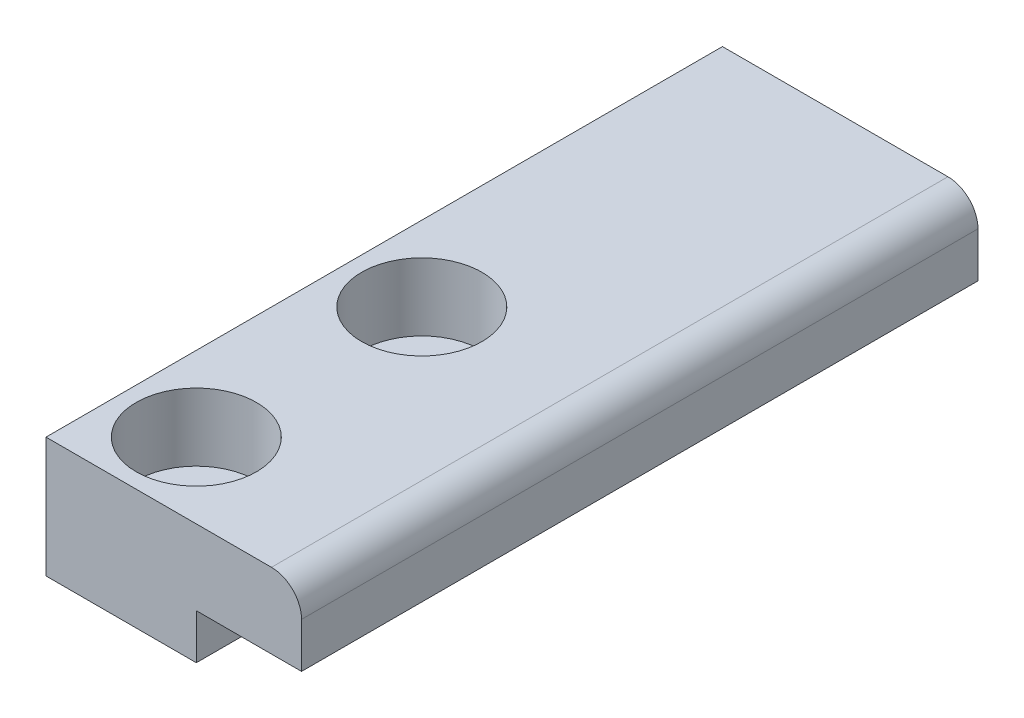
ISO-10303-21;
HEADER;
FILE_DESCRIPTION(('STEP AP214'),'2;1');
FILE_NAME('part.step','',(''),(''),'','','');
FILE_SCHEMA(('AUTOMOTIVE_DESIGN { 1 0 10303 214 1 1 1 1 }'));
ENDSEC;
DATA;
#1=APPLICATION_CONTEXT('core data for automotive mechanical design processes');
#2=APPLICATION_PROTOCOL_DEFINITION('international standard','automotive_design',2000,#1);
#3=PRODUCT_CONTEXT('',#1,'mechanical');
#4=PRODUCT('Part','Part','',(#3));
#5=PRODUCT_RELATED_PRODUCT_CATEGORY('part','',(#4));
#6=PRODUCT_DEFINITION_FORMATION('','',#4);
#7=PRODUCT_DEFINITION_CONTEXT('part definition',#1,'design');
#8=PRODUCT_DEFINITION('design','',#6,#7);
#9=PRODUCT_DEFINITION_SHAPE('','',#8);
#10=(LENGTH_UNIT() NAMED_UNIT(*) SI_UNIT(.MILLI.,.METRE.));
#11=(NAMED_UNIT(*) PLANE_ANGLE_UNIT() SI_UNIT($,.RADIAN.));
#12=(NAMED_UNIT(*) SI_UNIT($,.STERADIAN.) SOLID_ANGLE_UNIT());
#13=UNCERTAINTY_MEASURE_WITH_UNIT(LENGTH_MEASURE(1.E-05),#10,'distance_accuracy_value','');
#14=(GEOMETRIC_REPRESENTATION_CONTEXT(3) GLOBAL_UNCERTAINTY_ASSIGNED_CONTEXT((#13)) GLOBAL_UNIT_ASSIGNED_CONTEXT((#10,
#11,#12)) REPRESENTATION_CONTEXT('',''));
#15=CARTESIAN_POINT('',(0.,0.,0.));
#16=DIRECTION('',(0.,0.,1.));
#17=DIRECTION('',(1.,0.,0.));
#18=AXIS2_PLACEMENT_3D('',#15,#16,#17);
#19=CARTESIAN_POINT('',(4.99999999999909,-37.,25.));
#20=DIRECTION('',(0.,1.,0.));
#21=DIRECTION('',(0.,0.,1.));
#22=AXIS2_PLACEMENT_3D('',#19,#20,#21);
#23=CYLINDRICAL_SURFACE('',#22,2.25);
#24=CARTESIAN_POINT('',(4.99999999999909,0.,25.));
#25=DIRECTION('',(0.,1.,0.));
#26=DIRECTION('',(0.,0.,1.));
#27=AXIS2_PLACEMENT_3D('',#24,#25,#26);
#28=CIRCLE('',#27,2.25);
#29=CARTESIAN_POINT('',(4.99999999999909,0.,27.25));
#30=VERTEX_POINT('',#29);
#31=EDGE_CURVE('E148',#30,#30,#28,.T.);
#32=CARTESIAN_POINT('',(4.99999999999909,3.5,25.));
#33=DIRECTION('',(0.,1.,0.));
#34=DIRECTION('',(0.,0.,1.));
#35=AXIS2_PLACEMENT_3D('',#32,#33,#34);
#36=CIRCLE('',#35,2.25);
#37=CARTESIAN_POINT('',(4.99999999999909,3.5,27.25));
#38=VERTEX_POINT('',#37);
#39=EDGE_CURVE('E36',#38,#38,#36,.F.);
#40=CARTESIAN_POINT('',(4.99999999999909,0.,27.25));
#41=CARTESIAN_POINT('',(4.99999999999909,0.0364583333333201,27.25));
#42=CARTESIAN_POINT('',(4.99999999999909,0.072916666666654,27.25));
#43=CARTESIAN_POINT('',(4.99999999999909,0.145833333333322,27.25));
#44=CARTESIAN_POINT('',(4.99999999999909,0.182291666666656,27.25));
#45=CARTESIAN_POINT('',(4.99999999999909,0.255208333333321,27.25));
#46=CARTESIAN_POINT('',(4.99999999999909,0.291666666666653,27.25));
#47=CARTESIAN_POINT('',(4.99999999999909,0.364583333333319,27.25));
#48=CARTESIAN_POINT('',(4.99999999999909,0.401041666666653,27.25));
#49=CARTESIAN_POINT('',(4.99999999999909,0.47395833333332,27.25));
#50=CARTESIAN_POINT('',(4.99999999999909,0.510416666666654,27.25));
#51=CARTESIAN_POINT('',(4.99999999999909,0.583333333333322,27.25));
#52=CARTESIAN_POINT('',(4.99999999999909,0.619791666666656,27.25));
#53=CARTESIAN_POINT('',(4.99999999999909,0.692708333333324,27.25));
#54=CARTESIAN_POINT('',(4.99999999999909,0.729166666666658,27.25));
#55=CARTESIAN_POINT('',(4.99999999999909,0.802083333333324,27.25));
#56=CARTESIAN_POINT('',(4.99999999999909,0.838541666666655,27.25));
#57=CARTESIAN_POINT('',(4.99999999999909,0.911458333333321,27.25));
#58=CARTESIAN_POINT('',(4.99999999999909,0.947916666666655,27.25));
#59=CARTESIAN_POINT('',(4.99999999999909,1.02083333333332,27.25));
#60=CARTESIAN_POINT('',(4.99999999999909,1.05729166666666,27.25));
#61=CARTESIAN_POINT('',(4.99999999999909,1.13020833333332,27.25));
#62=CARTESIAN_POINT('',(4.99999999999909,1.16666666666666,27.25));
#63=CARTESIAN_POINT('',(4.99999999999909,1.23958333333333,27.25));
#64=CARTESIAN_POINT('',(4.99999999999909,1.27604166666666,27.25));
#65=CARTESIAN_POINT('',(4.99999999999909,1.34895833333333,27.25));
#66=CARTESIAN_POINT('',(4.99999999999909,1.38541666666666,27.25));
#67=CARTESIAN_POINT('',(4.99999999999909,1.45833333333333,27.25));
#68=CARTESIAN_POINT('',(4.99999999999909,1.49479166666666,27.25));
#69=CARTESIAN_POINT('',(4.99999999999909,1.56770833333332,27.25));
#70=CARTESIAN_POINT('',(4.99999999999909,1.60416666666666,27.25));
#71=CARTESIAN_POINT('',(4.99999999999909,1.67708333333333,27.25));
#72=CARTESIAN_POINT('',(4.99999999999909,1.71354166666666,27.25));
#73=CARTESIAN_POINT('',(4.99999999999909,1.78645833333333,27.25));
#74=CARTESIAN_POINT('',(4.99999999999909,1.82291666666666,27.25));
#75=CARTESIAN_POINT('',(4.99999999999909,1.89583333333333,27.25));
#76=CARTESIAN_POINT('',(4.99999999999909,1.93229166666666,27.25));
#77=CARTESIAN_POINT('',(4.99999999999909,2.00520833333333,27.25));
#78=CARTESIAN_POINT('',(4.99999999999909,2.04166666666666,27.25));
#79=CARTESIAN_POINT('',(4.99999999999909,2.11458333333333,27.25));
#80=CARTESIAN_POINT('',(4.99999999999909,2.15104166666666,27.25));
#81=CARTESIAN_POINT('',(4.99999999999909,2.22395833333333,27.25));
#82=CARTESIAN_POINT('',(4.99999999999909,2.26041666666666,27.25));
#83=CARTESIAN_POINT('',(4.99999999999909,2.33333333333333,27.25));
#84=CARTESIAN_POINT('',(4.99999999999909,2.36979166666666,27.25));
#85=CARTESIAN_POINT('',(4.99999999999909,2.44270833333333,27.25));
#86=CARTESIAN_POINT('',(4.99999999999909,2.47916666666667,27.25));
#87=CARTESIAN_POINT('',(4.99999999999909,2.55208333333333,27.25));
#88=CARTESIAN_POINT('',(4.99999999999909,2.58854166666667,27.25));
#89=CARTESIAN_POINT('',(4.99999999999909,2.66145833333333,27.25));
#90=CARTESIAN_POINT('',(4.99999999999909,2.69791666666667,27.25));
#91=CARTESIAN_POINT('',(4.99999999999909,2.77083333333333,27.25));
#92=CARTESIAN_POINT('',(4.99999999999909,2.80729166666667,27.25));
#93=CARTESIAN_POINT('',(4.99999999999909,2.88020833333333,27.25));
#94=CARTESIAN_POINT('',(4.99999999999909,2.91666666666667,27.25));
#95=CARTESIAN_POINT('',(4.99999999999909,2.98958333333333,27.25));
#96=CARTESIAN_POINT('',(4.99999999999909,3.02604166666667,27.25));
#97=CARTESIAN_POINT('',(4.99999999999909,3.09895833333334,27.25));
#98=CARTESIAN_POINT('',(4.99999999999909,3.13541666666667,27.25));
#99=CARTESIAN_POINT('',(4.99999999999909,3.20833333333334,27.25));
#100=CARTESIAN_POINT('',(4.99999999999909,3.24479166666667,27.25));
#101=CARTESIAN_POINT('',(4.99999999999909,3.31770833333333,27.25));
#102=CARTESIAN_POINT('',(4.99999999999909,3.35416666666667,27.25));
#103=CARTESIAN_POINT('',(4.99999999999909,3.42708333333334,27.25));
#104=CARTESIAN_POINT('',(4.99999999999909,3.46354166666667,27.25));
#105=CARTESIAN_POINT('',(4.99999999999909,3.5,27.25));
#106=B_SPLINE_CURVE_WITH_KNOTS('',3,(#40,#41,#42,#43,#44,#45,#46,#47,#48,#49,#50,#51,#52,#53,
#54,#55,#56,#57,#58,#59,#60,#61,#62,#63,#64,#65,#66,#67,#68,#69,#70,#71,#72,#73,#74,#75,#76,#77,
#78,#79,#80,#81,#82,#83,#84,#85,#86,#87,#88,#89,#90,#91,#92,#93,#94,#95,#96,#97,#98,#99,#100,
#101,#102,#103,#104,#105),.UNSPECIFIED.,.F.,.F.,(4,2,2,2,2,2,2,2,2,2,2,2,2,2,2,2,2,2,2,2,2,2,2,
2,2,2,2,2,2,2,2,2,4),(0.,0.109375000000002,0.218750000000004,0.328124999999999,0.4375,
0.546875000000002,0.656250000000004,0.765625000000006,0.875000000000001,0.984375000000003,
1.09375,1.20312500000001,1.31250000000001,1.42187500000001,1.53125,1.64062500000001,
1.75000000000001,1.85937500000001,1.96875000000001,2.07812500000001,2.18750000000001,
2.29687500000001,2.40625000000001,2.51562500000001,2.62500000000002,2.73437500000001,
2.84375000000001,2.95312500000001,3.06250000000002,3.17187500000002,3.28125000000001,
3.39062500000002,3.50000000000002),.UNSPECIFIED.);
#107=EDGE_CURVE('BSEAM32',#30,#38,#106,.T.);
#108=ORIENTED_EDGE('',*,*,#31,.F.);
#109=ORIENTED_EDGE('',*,*,#39,.F.);
#110=ORIENTED_EDGE('',*,*,#107,.T.);
#111=ORIENTED_EDGE('',*,*,#107,.F.);
#112=EDGE_LOOP('',(#108,#110,#109,#111));
#113=FACE_BOUND('',#112,.T.);
#114=ADVANCED_FACE('F32',(#113),#23,.F.);
#115=CARTESIAN_POINT('',(5.,-37.,40.));
#116=DIRECTION('',(0.,1.,0.));
#117=DIRECTION('',(0.,0.,1.));
#118=AXIS2_PLACEMENT_3D('',#115,#116,#117);
#119=CYLINDRICAL_SURFACE('',#118,2.25);
#120=CARTESIAN_POINT('',(5.,0.,40.));
#121=DIRECTION('',(0.,1.,0.));
#122=DIRECTION('',(0.,0.,1.));
#123=AXIS2_PLACEMENT_3D('',#120,#121,#122);
#124=CIRCLE('',#123,2.25);
#125=CARTESIAN_POINT('',(5.,0.,42.25));
#126=VERTEX_POINT('',#125);
#127=EDGE_CURVE('E129',#126,#126,#124,.T.);
#128=CARTESIAN_POINT('',(5.,3.5,40.));
#129=DIRECTION('',(0.,1.,0.));
#130=DIRECTION('',(0.,0.,1.));
#131=AXIS2_PLACEMENT_3D('',#128,#129,#130);
#132=CIRCLE('',#131,2.25);
#133=CARTESIAN_POINT('',(5.,3.5,42.25));
#134=VERTEX_POINT('',#133);
#135=EDGE_CURVE('E146',#134,#134,#132,.F.);
#136=CARTESIAN_POINT('',(5.,0.,42.25));
#137=CARTESIAN_POINT('',(5.,0.0364583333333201,42.25));
#138=CARTESIAN_POINT('',(5.,0.072916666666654,42.25));
#139=CARTESIAN_POINT('',(5.,0.145833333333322,42.25));
#140=CARTESIAN_POINT('',(5.,0.182291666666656,42.25));
#141=CARTESIAN_POINT('',(5.,0.255208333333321,42.25));
#142=CARTESIAN_POINT('',(5.,0.291666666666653,42.25));
#143=CARTESIAN_POINT('',(5.,0.364583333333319,42.25));
#144=CARTESIAN_POINT('',(5.,0.401041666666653,42.25));
#145=CARTESIAN_POINT('',(5.,0.47395833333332,42.25));
#146=CARTESIAN_POINT('',(5.,0.510416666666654,42.25));
#147=CARTESIAN_POINT('',(5.,0.583333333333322,42.25));
#148=CARTESIAN_POINT('',(5.,0.619791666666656,42.25));
#149=CARTESIAN_POINT('',(5.,0.692708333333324,42.25));
#150=CARTESIAN_POINT('',(5.,0.729166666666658,42.25));
#151=CARTESIAN_POINT('',(5.,0.802083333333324,42.25));
#152=CARTESIAN_POINT('',(5.,0.838541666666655,42.25));
#153=CARTESIAN_POINT('',(5.,0.911458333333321,42.25));
#154=CARTESIAN_POINT('',(5.,0.947916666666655,42.25));
#155=CARTESIAN_POINT('',(5.,1.02083333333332,42.25));
#156=CARTESIAN_POINT('',(5.,1.05729166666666,42.25));
#157=CARTESIAN_POINT('',(5.,1.13020833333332,42.25));
#158=CARTESIAN_POINT('',(5.,1.16666666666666,42.25));
#159=CARTESIAN_POINT('',(5.,1.23958333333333,42.25));
#160=CARTESIAN_POINT('',(5.,1.27604166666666,42.25));
#161=CARTESIAN_POINT('',(5.,1.34895833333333,42.25));
#162=CARTESIAN_POINT('',(5.,1.38541666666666,42.25));
#163=CARTESIAN_POINT('',(5.,1.45833333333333,42.25));
#164=CARTESIAN_POINT('',(5.,1.49479166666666,42.25));
#165=CARTESIAN_POINT('',(5.,1.56770833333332,42.25));
#166=CARTESIAN_POINT('',(5.,1.60416666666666,42.25));
#167=CARTESIAN_POINT('',(5.,1.67708333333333,42.25));
#168=CARTESIAN_POINT('',(5.,1.71354166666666,42.25));
#169=CARTESIAN_POINT('',(5.,1.78645833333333,42.25));
#170=CARTESIAN_POINT('',(5.,1.82291666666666,42.25));
#171=CARTESIAN_POINT('',(5.,1.89583333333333,42.25));
#172=CARTESIAN_POINT('',(5.,1.93229166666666,42.25));
#173=CARTESIAN_POINT('',(5.,2.00520833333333,42.25));
#174=CARTESIAN_POINT('',(5.,2.04166666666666,42.25));
#175=CARTESIAN_POINT('',(5.,2.11458333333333,42.25));
#176=CARTESIAN_POINT('',(5.,2.15104166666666,42.25));
#177=CARTESIAN_POINT('',(5.,2.22395833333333,42.25));
#178=CARTESIAN_POINT('',(5.,2.26041666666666,42.25));
#179=CARTESIAN_POINT('',(5.,2.33333333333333,42.25));
#180=CARTESIAN_POINT('',(5.,2.36979166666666,42.25));
#181=CARTESIAN_POINT('',(5.,2.44270833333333,42.25));
#182=CARTESIAN_POINT('',(5.,2.47916666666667,42.25));
#183=CARTESIAN_POINT('',(5.,2.55208333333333,42.25));
#184=CARTESIAN_POINT('',(5.,2.58854166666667,42.25));
#185=CARTESIAN_POINT('',(5.,2.66145833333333,42.25));
#186=CARTESIAN_POINT('',(5.,2.69791666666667,42.25));
#187=CARTESIAN_POINT('',(5.,2.77083333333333,42.25));
#188=CARTESIAN_POINT('',(5.,2.80729166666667,42.25));
#189=CARTESIAN_POINT('',(5.,2.88020833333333,42.25));
#190=CARTESIAN_POINT('',(5.,2.91666666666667,42.25));
#191=CARTESIAN_POINT('',(5.,2.98958333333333,42.25));
#192=CARTESIAN_POINT('',(5.,3.02604166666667,42.25));
#193=CARTESIAN_POINT('',(5.,3.09895833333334,42.25));
#194=CARTESIAN_POINT('',(5.,3.13541666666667,42.25));
#195=CARTESIAN_POINT('',(5.,3.20833333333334,42.25));
#196=CARTESIAN_POINT('',(5.,3.24479166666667,42.25));
#197=CARTESIAN_POINT('',(5.,3.31770833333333,42.25));
#198=CARTESIAN_POINT('',(5.,3.35416666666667,42.25));
#199=CARTESIAN_POINT('',(5.,3.42708333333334,42.25));
#200=CARTESIAN_POINT('',(5.,3.46354166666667,42.25));
#201=CARTESIAN_POINT('',(5.,3.5,42.25));
#202=B_SPLINE_CURVE_WITH_KNOTS('',3,(#136,#137,#138,#139,#140,#141,#142,#143,#144,#145,#146,
#147,#148,#149,#150,#151,#152,#153,#154,#155,#156,#157,#158,#159,#160,#161,#162,#163,#164,#165,
#166,#167,#168,#169,#170,#171,#172,#173,#174,#175,#176,#177,#178,#179,#180,#181,#182,#183,#184,
#185,#186,#187,#188,#189,#190,#191,#192,#193,#194,#195,#196,#197,#198,#199,#200,#201),
.UNSPECIFIED.,.F.,.F.,(4,2,2,2,2,2,2,2,2,2,2,2,2,2,2,2,2,2,2,2,2,2,2,2,2,2,2,2,2,2,2,2,4),(0.,
0.109375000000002,0.218750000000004,0.328124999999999,0.4375,0.546875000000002,
0.656250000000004,0.765625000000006,0.875000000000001,0.984375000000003,1.09375,
1.20312500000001,1.31250000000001,1.42187500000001,1.53125,1.64062500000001,1.75000000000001,
1.85937500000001,1.96875000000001,2.07812500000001,2.18750000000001,2.29687500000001,
2.40625000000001,2.51562500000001,2.62500000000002,2.73437500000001,2.84375000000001,
2.95312500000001,3.06250000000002,3.17187500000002,3.28125000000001,3.39062500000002,
3.50000000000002),.UNSPECIFIED.);
#203=EDGE_CURVE('BSEAM196',#126,#134,#202,.T.);
#204=ORIENTED_EDGE('',*,*,#127,.F.);
#205=ORIENTED_EDGE('',*,*,#135,.F.);
#206=ORIENTED_EDGE('',*,*,#203,.T.);
#207=ORIENTED_EDGE('',*,*,#203,.F.);
#208=EDGE_LOOP('',(#204,#206,#205,#207));
#209=FACE_BOUND('',#208,.T.);
#210=ADVANCED_FACE('F196',(#209),#119,.F.);
#211=CARTESIAN_POINT('',(0.,0.,45.));
#212=DIRECTION('',(0.,1.,0.));
#213=DIRECTION('',(0.,0.,1.));
#214=AXIS2_PLACEMENT_3D('',#211,#212,#213);
#215=PLANE('',#214);
#216=ORIENTED_EDGE('',*,*,#31,.T.);
#217=EDGE_LOOP('',(#216));
#218=FACE_BOUND('',#217,.T.);
#219=ORIENTED_EDGE('',*,*,#127,.T.);
#220=EDGE_LOOP('',(#219));
#221=FACE_BOUND('',#220,.T.);
#222=DIRECTION('',(1.,0.,0.));
#223=VECTOR('',#222,1.);
#224=CARTESIAN_POINT('',(0.,0.,0.));
#225=LINE('',#224,#223);
#226=CARTESIAN_POINT('',(0.,0.,0.));
#227=VERTEX_POINT('',#226);
#228=CARTESIAN_POINT('',(10.,0.,0.));
#229=VERTEX_POINT('',#228);
#230=EDGE_CURVE('E125',#227,#229,#225,.T.);
#231=ORIENTED_EDGE('',*,*,#230,.T.);
#232=DIRECTION('',(0.,0.,-1.));
#233=VECTOR('',#232,1.);
#234=CARTESIAN_POINT('',(10.,0.,45.));
#235=LINE('',#234,#233);
#236=CARTESIAN_POINT('',(10.,0.,45.));
#237=VERTEX_POINT('',#236);
#238=EDGE_CURVE('E11',#237,#229,#235,.T.);
#239=ORIENTED_EDGE('',*,*,#238,.F.);
#240=DIRECTION('',(1.,0.,0.));
#241=VECTOR('',#240,1.);
#242=CARTESIAN_POINT('',(0.,0.,45.));
#243=LINE('',#242,#241);
#244=CARTESIAN_POINT('',(0.,0.,45.));
#245=VERTEX_POINT('',#244);
#246=EDGE_CURVE('E138',#245,#237,#243,.T.);
#247=ORIENTED_EDGE('',*,*,#246,.F.);
#248=DIRECTION('',(0.,0.,-1.));
#249=VECTOR('',#248,1.);
#250=CARTESIAN_POINT('',(0.,0.,45.));
#251=LINE('',#250,#249);
#252=EDGE_CURVE('E121',#245,#227,#251,.T.);
#253=ORIENTED_EDGE('',*,*,#252,.T.);
#254=EDGE_LOOP('',(#231,#239,#247,#253));
#255=FACE_BOUND('',#254,.T.);
#256=ADVANCED_FACE('F34',(#218,#221,#255),#215,.F.);
#257=CARTESIAN_POINT('',(10.,0.,45.));
#258=DIRECTION('',(-1.,0.,0.));
#259=DIRECTION('',(0.,0.,1.));
#260=AXIS2_PLACEMENT_3D('',#257,#258,#259);
#261=PLANE('',#260);
#262=DIRECTION('',(0.,1.,0.));
#263=VECTOR('',#262,1.);
#264=CARTESIAN_POINT('',(10.,0.,0.));
#265=LINE('',#264,#263);
#266=CARTESIAN_POINT('',(10.,3.,0.));
#267=VERTEX_POINT('',#266);
#268=EDGE_CURVE('E128',#229,#267,#265,.T.);
#269=ORIENTED_EDGE('',*,*,#268,.T.);
#270=DIRECTION('',(0.,0.,-1.));
#271=VECTOR('',#270,1.);
#272=CARTESIAN_POINT('',(10.,3.,45.));
#273=LINE('',#272,#271);
#274=CARTESIAN_POINT('',(10.,3.,45.));
#275=VERTEX_POINT('',#274);
#276=EDGE_CURVE('E42',#275,#267,#273,.T.);
#277=ORIENTED_EDGE('',*,*,#276,.F.);
#278=DIRECTION('',(0.,1.,0.));
#279=VECTOR('',#278,1.);
#280=CARTESIAN_POINT('',(10.,0.,45.));
#281=LINE('',#280,#279);
#282=EDGE_CURVE('E91',#237,#275,#281,.T.);
#283=ORIENTED_EDGE('',*,*,#282,.F.);
#284=ORIENTED_EDGE('',*,*,#238,.T.);
#285=EDGE_LOOP('',(#269,#277,#283,#284));
#286=FACE_BOUND('',#285,.T.);
#287=ADVANCED_FACE('F308',(#286),#261,.F.);
#288=CARTESIAN_POINT('',(10.,3.,45.));
#289=DIRECTION('',(0.,1.,0.));
#290=DIRECTION('',(0.,0.,1.));
#291=AXIS2_PLACEMENT_3D('',#288,#289,#290);
#292=PLANE('',#291);
#293=DIRECTION('',(1.,0.,0.));
#294=VECTOR('',#293,1.);
#295=CARTESIAN_POINT('',(10.,3.,0.));
#296=LINE('',#295,#294);
#297=CARTESIAN_POINT('',(17.,3.,0.));
#298=VERTEX_POINT('',#297);
#299=EDGE_CURVE('E131',#267,#298,#296,.T.);
#300=ORIENTED_EDGE('',*,*,#299,.T.);
#301=DIRECTION('',(0.,0.,-1.));
#302=VECTOR('',#301,1.);
#303=CARTESIAN_POINT('',(17.,3.,45.));
#304=LINE('',#303,#302);
#305=CARTESIAN_POINT('',(17.,3.,45.));
#306=VERTEX_POINT('',#305);
#307=EDGE_CURVE('E142',#306,#298,#304,.T.);
#308=ORIENTED_EDGE('',*,*,#307,.F.);
#309=DIRECTION('',(1.,0.,0.));
#310=VECTOR('',#309,1.);
#311=CARTESIAN_POINT('',(10.,3.,45.));
#312=LINE('',#311,#310);
#313=EDGE_CURVE('E169',#275,#306,#312,.T.);
#314=ORIENTED_EDGE('',*,*,#313,.F.);
#315=ORIENTED_EDGE('',*,*,#276,.T.);
#316=EDGE_LOOP('',(#300,#308,#314,#315));
#317=FACE_BOUND('',#316,.T.);
#318=ADVANCED_FACE('F173',(#317),#292,.F.);
#319=CARTESIAN_POINT('',(17.,3.,45.));
#320=DIRECTION('',(-1.,0.,0.));
#321=DIRECTION('',(0.,0.,1.));
#322=AXIS2_PLACEMENT_3D('',#319,#320,#321);
#323=PLANE('',#322);
#324=DIRECTION('',(0.,1.,0.));
#325=VECTOR('',#324,1.);
#326=CARTESIAN_POINT('',(17.,3.,0.));
#327=LINE('',#326,#325);
#328=CARTESIAN_POINT('',(17.,6.,0.));
#329=VERTEX_POINT('',#328);
#330=EDGE_CURVE('E133',#298,#329,#327,.T.);
#331=ORIENTED_EDGE('',*,*,#330,.T.);
#332=DIRECTION('',(0.,0.,-1.));
#333=VECTOR('',#332,1.);
#334=CARTESIAN_POINT('',(17.,6.,45.));
#335=LINE('',#334,#333);
#336=CARTESIAN_POINT('',(17.,6.,45.));
#337=VERTEX_POINT('',#336);
#338=EDGE_CURVE('E116',#337,#329,#335,.T.);
#339=ORIENTED_EDGE('',*,*,#338,.F.);
#340=DIRECTION('',(0.,1.,0.));
#341=VECTOR('',#340,1.);
#342=CARTESIAN_POINT('',(17.,3.,45.));
#343=LINE('',#342,#341);
#344=EDGE_CURVE('E107',#306,#337,#343,.T.);
#345=ORIENTED_EDGE('',*,*,#344,.F.);
#346=ORIENTED_EDGE('',*,*,#307,.T.);
#347=EDGE_LOOP('',(#331,#339,#345,#346));
#348=FACE_BOUND('',#347,.T.);
#349=ADVANCED_FACE('F177',(#348),#323,.F.);
#350=CARTESIAN_POINT('',(15.,6.,45.));
#351=DIRECTION('',(0.,0.,-1.));
#352=DIRECTION('',(-1.,0.,0.));
#353=AXIS2_PLACEMENT_3D('',#350,#351,#352);
#354=CYLINDRICAL_SURFACE('',#353,2.);
#355=CARTESIAN_POINT('',(15.,6.,0.));
#356=DIRECTION('',(0.,0.,1.));
#357=DIRECTION('',(1.,0.,0.));
#358=AXIS2_PLACEMENT_3D('',#355,#356,#357);
#359=CIRCLE('',#358,2.);
#360=CARTESIAN_POINT('',(15.,8.,0.));
#361=VERTEX_POINT('',#360);
#362=EDGE_CURVE('E115',#329,#361,#359,.T.);
#363=ORIENTED_EDGE('',*,*,#362,.T.);
#364=DIRECTION('',(0.,0.,-1.));
#365=VECTOR('',#364,1.);
#366=CARTESIAN_POINT('',(15.,8.,45.));
#367=LINE('',#366,#365);
#368=CARTESIAN_POINT('',(15.,8.,45.));
#369=VERTEX_POINT('',#368);
#370=EDGE_CURVE('E112',#369,#361,#367,.T.);
#371=ORIENTED_EDGE('',*,*,#370,.F.);
#372=CARTESIAN_POINT('',(15.,6.,45.));
#373=DIRECTION('',(0.,0.,1.));
#374=DIRECTION('',(1.,0.,0.));
#375=AXIS2_PLACEMENT_3D('',#372,#373,#374);
#376=CIRCLE('',#375,2.);
#377=EDGE_CURVE('E101',#337,#369,#376,.T.);
#378=ORIENTED_EDGE('',*,*,#377,.F.);
#379=ORIENTED_EDGE('',*,*,#338,.T.);
#380=EDGE_LOOP('',(#363,#371,#378,#379));
#381=FACE_BOUND('',#380,.T.);
#382=ADVANCED_FACE('F113',(#381),#354,.T.);
#383=CARTESIAN_POINT('',(0.,8.,45.));
#384=DIRECTION('',(0.,-1.,0.));
#385=DIRECTION('',(0.,0.,-1.));
#386=AXIS2_PLACEMENT_3D('',#383,#384,#385);
#387=PLANE('',#386);
#388=CARTESIAN_POINT('',(4.99999999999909,8.,25.));
#389=DIRECTION('',(0.,1.,0.));
#390=DIRECTION('',(0.,0.,1.));
#391=AXIS2_PLACEMENT_3D('',#388,#389,#390);
#392=CIRCLE('',#391,4.);
#393=CARTESIAN_POINT('',(4.99999999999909,8.,29.));
#394=VERTEX_POINT('',#393);
#395=EDGE_CURVE('E162',#394,#394,#392,.T.);
#396=ORIENTED_EDGE('',*,*,#395,.F.);
#397=EDGE_LOOP('',(#396));
#398=FACE_BOUND('',#397,.T.);
#399=CARTESIAN_POINT('',(5.,8.,40.));
#400=DIRECTION('',(0.,1.,0.));
#401=DIRECTION('',(0.,0.,1.));
#402=AXIS2_PLACEMENT_3D('',#399,#400,#401);
#403=CIRCLE('',#402,4.);
#404=CARTESIAN_POINT('',(5.,8.,44.));
#405=VERTEX_POINT('',#404);
#406=EDGE_CURVE('E155',#405,#405,#403,.T.);
#407=ORIENTED_EDGE('',*,*,#406,.F.);
#408=EDGE_LOOP('',(#407));
#409=FACE_BOUND('',#408,.T.);
#410=DIRECTION('',(-1.,0.,0.));
#411=VECTOR('',#410,1.);
#412=CARTESIAN_POINT('',(0.,8.,0.));
#413=LINE('',#412,#411);
#414=CARTESIAN_POINT('',(0.,8.,0.));
#415=VERTEX_POINT('',#414);
#416=EDGE_CURVE('E77',#361,#415,#413,.T.);
#417=ORIENTED_EDGE('',*,*,#416,.T.);
#418=DIRECTION('',(0.,0.,-1.));
#419=VECTOR('',#418,1.);
#420=CARTESIAN_POINT('',(0.,8.,45.));
#421=LINE('',#420,#419);
#422=CARTESIAN_POINT('',(0.,8.,45.));
#423=VERTEX_POINT('',#422);
#424=EDGE_CURVE('E117',#423,#415,#421,.T.);
#425=ORIENTED_EDGE('',*,*,#424,.F.);
#426=DIRECTION('',(-1.,0.,0.));
#427=VECTOR('',#426,1.);
#428=CARTESIAN_POINT('',(0.,8.,45.));
#429=LINE('',#428,#427);
#430=EDGE_CURVE('E105',#369,#423,#429,.T.);
#431=ORIENTED_EDGE('',*,*,#430,.F.);
#432=ORIENTED_EDGE('',*,*,#370,.T.);
#433=EDGE_LOOP('',(#417,#425,#431,#432));
#434=FACE_BOUND('',#433,.T.);
#435=ADVANCED_FACE('F119',(#398,#409,#434),#387,.F.);
#436=CARTESIAN_POINT('',(0.,0.,45.));
#437=DIRECTION('',(1.,0.,0.));
#438=DIRECTION('',(0.,0.,-1.));
#439=AXIS2_PLACEMENT_3D('',#436,#437,#438);
#440=PLANE('',#439);
#441=DIRECTION('',(0.,-1.,0.));
#442=VECTOR('',#441,1.);
#443=CARTESIAN_POINT('',(0.,0.,0.));
#444=LINE('',#443,#442);
#445=EDGE_CURVE('E83',#415,#227,#444,.T.);
#446=ORIENTED_EDGE('',*,*,#445,.T.);
#447=ORIENTED_EDGE('',*,*,#252,.F.);
#448=DIRECTION('',(0.,-1.,0.));
#449=VECTOR('',#448,1.);
#450=CARTESIAN_POINT('',(0.,0.,45.));
#451=LINE('',#450,#449);
#452=EDGE_CURVE('E51',#423,#245,#451,.T.);
#453=ORIENTED_EDGE('',*,*,#452,.F.);
#454=ORIENTED_EDGE('',*,*,#424,.T.);
#455=EDGE_LOOP('',(#446,#447,#453,#454));
#456=FACE_BOUND('',#455,.T.);
#457=ADVANCED_FACE('F184',(#456),#440,.F.);
#458=CARTESIAN_POINT('',(15.,6.,45.));
#459=DIRECTION('',(0.,0.,1.));
#460=DIRECTION('',(1.,0.,0.));
#461=AXIS2_PLACEMENT_3D('',#458,#459,#460);
#462=PLANE('',#461);
#463=ORIENTED_EDGE('',*,*,#246,.T.);
#464=ORIENTED_EDGE('',*,*,#282,.T.);
#465=ORIENTED_EDGE('',*,*,#313,.T.);
#466=ORIENTED_EDGE('',*,*,#344,.T.);
#467=ORIENTED_EDGE('',*,*,#377,.T.);
#468=ORIENTED_EDGE('',*,*,#430,.T.);
#469=ORIENTED_EDGE('',*,*,#452,.T.);
#470=EDGE_LOOP('',(#463,#464,#465,#466,#467,#468,#469));
#471=FACE_BOUND('',#470,.T.);
#472=ADVANCED_FACE('F103',(#471),#462,.T.);
#473=CARTESIAN_POINT('',(15.,6.,0.));
#474=DIRECTION('',(0.,0.,1.));
#475=DIRECTION('',(1.,0.,0.));
#476=AXIS2_PLACEMENT_3D('',#473,#474,#475);
#477=PLANE('',#476);
#478=ORIENTED_EDGE('',*,*,#230,.F.);
#479=ORIENTED_EDGE('',*,*,#445,.F.);
#480=ORIENTED_EDGE('',*,*,#416,.F.);
#481=ORIENTED_EDGE('',*,*,#362,.F.);
#482=ORIENTED_EDGE('',*,*,#330,.F.);
#483=ORIENTED_EDGE('',*,*,#299,.F.);
#484=ORIENTED_EDGE('',*,*,#268,.F.);
#485=EDGE_LOOP('',(#478,#479,#480,#481,#482,#483,#484));
#486=FACE_BOUND('',#485,.T.);
#487=ADVANCED_FACE('F180',(#486),#477,.F.);
#488=CARTESIAN_POINT('',(5.,3.5,40.));
#489=DIRECTION('',(0.,1.,0.));
#490=DIRECTION('',(0.,0.,1.));
#491=AXIS2_PLACEMENT_3D('',#488,#489,#490);
#492=PLANE('',#491);
#493=CARTESIAN_POINT('',(5.,3.5,40.));
#494=DIRECTION('',(0.,1.,0.));
#495=DIRECTION('',(0.,0.,1.));
#496=AXIS2_PLACEMENT_3D('',#493,#494,#495);
#497=CIRCLE('',#496,4.);
#498=CARTESIAN_POINT('',(5.,3.5,44.));
#499=VERTEX_POINT('',#498);
#500=EDGE_CURVE('E149',#499,#499,#497,.T.);
#501=ORIENTED_EDGE('',*,*,#500,.T.);
#502=EDGE_LOOP('',(#501));
#503=FACE_BOUND('',#502,.T.);
#504=ORIENTED_EDGE('',*,*,#135,.T.);
#505=EDGE_LOOP('',(#504));
#506=FACE_BOUND('',#505,.T.);
#507=ADVANCED_FACE('F210',(#503,#506),#492,.T.);
#508=CARTESIAN_POINT('',(5.,3.5,40.));
#509=DIRECTION('',(0.,1.,0.));
#510=DIRECTION('',(0.,0.,1.));
#511=AXIS2_PLACEMENT_3D('',#508,#509,#510);
#512=CYLINDRICAL_SURFACE('',#511,4.);
#513=ORIENTED_EDGE('',*,*,#500,.F.);
#514=EDGE_LOOP('',(#513));
#515=FACE_BOUND('',#514,.T.);
#516=ORIENTED_EDGE('',*,*,#406,.T.);
#517=EDGE_LOOP('',(#516));
#518=FACE_BOUND('',#517,.T.);
#519=ADVANCED_FACE('F207',(#515,#518),#512,.F.);
#520=CARTESIAN_POINT('',(4.99999999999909,3.5,25.));
#521=DIRECTION('',(0.,1.,0.));
#522=DIRECTION('',(0.,0.,1.));
#523=AXIS2_PLACEMENT_3D('',#520,#521,#522);
#524=PLANE('',#523);
#525=CARTESIAN_POINT('',(4.99999999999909,3.5,25.));
#526=DIRECTION('',(0.,1.,0.));
#527=DIRECTION('',(0.,0.,1.));
#528=AXIS2_PLACEMENT_3D('',#525,#526,#527);
#529=CIRCLE('',#528,4.);
#530=CARTESIAN_POINT('',(4.99999999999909,3.5,29.));
#531=VERTEX_POINT('',#530);
#532=EDGE_CURVE('E231',#531,#531,#529,.T.);
#533=ORIENTED_EDGE('',*,*,#532,.T.);
#534=EDGE_LOOP('',(#533));
#535=FACE_BOUND('',#534,.T.);
#536=ORIENTED_EDGE('',*,*,#39,.T.);
#537=EDGE_LOOP('',(#536));
#538=FACE_BOUND('',#537,.T.);
#539=ADVANCED_FACE('F217',(#535,#538),#524,.T.);
#540=CARTESIAN_POINT('',(4.99999999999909,3.5,25.));
#541=DIRECTION('',(0.,1.,0.));
#542=DIRECTION('',(0.,0.,1.));
#543=AXIS2_PLACEMENT_3D('',#540,#541,#542);
#544=CYLINDRICAL_SURFACE('',#543,4.);
#545=ORIENTED_EDGE('',*,*,#532,.F.);
#546=EDGE_LOOP('',(#545));
#547=FACE_BOUND('',#546,.T.);
#548=ORIENTED_EDGE('',*,*,#395,.T.);
#549=EDGE_LOOP('',(#548));
#550=FACE_BOUND('',#549,.T.);
#551=ADVANCED_FACE('F220',(#547,#550),#544,.F.);
#552=CLOSED_SHELL('',(#114,#210,#256,#287,#318,#349,#382,#435,#457,#472,#487,#507,#519,#539,#551));
#553=MANIFOLD_SOLID_BREP('B2',#552);
#554=ADVANCED_BREP_SHAPE_REPRESENTATION('',(#18,#553),#14);
#555=SHAPE_DEFINITION_REPRESENTATION(#9,#554);
ENDSEC;
END-ISO-10303-21;
